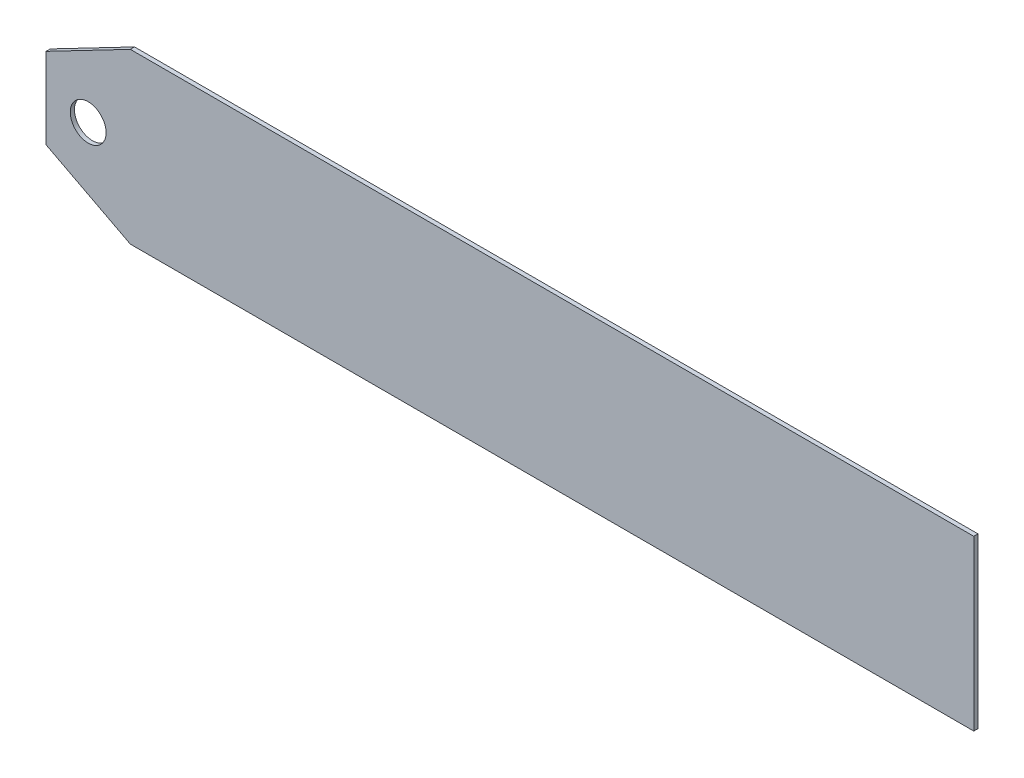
ISO-10303-21;
HEADER;
FILE_DESCRIPTION(('STEP AP214'),'2;1');
FILE_NAME('part.step','',(''),(''),'','','');
FILE_SCHEMA(('AUTOMOTIVE_DESIGN { 1 0 10303 214 1 1 1 1 }'));
ENDSEC;
DATA;
#1=APPLICATION_CONTEXT('core data for automotive mechanical design processes');
#2=APPLICATION_PROTOCOL_DEFINITION('international standard','automotive_design',2000,#1);
#3=PRODUCT_CONTEXT('',#1,'mechanical');
#4=PRODUCT('Part','Part','',(#3));
#5=PRODUCT_RELATED_PRODUCT_CATEGORY('part','',(#4));
#6=PRODUCT_DEFINITION_FORMATION('','',#4);
#7=PRODUCT_DEFINITION_CONTEXT('part definition',#1,'design');
#8=PRODUCT_DEFINITION('design','',#6,#7);
#9=PRODUCT_DEFINITION_SHAPE('','',#8);
#10=(LENGTH_UNIT() NAMED_UNIT(*) SI_UNIT(.MILLI.,.METRE.));
#11=(NAMED_UNIT(*) PLANE_ANGLE_UNIT() SI_UNIT($,.RADIAN.));
#12=(NAMED_UNIT(*) SI_UNIT($,.STERADIAN.) SOLID_ANGLE_UNIT());
#13=UNCERTAINTY_MEASURE_WITH_UNIT(LENGTH_MEASURE(1.E-05),#10,'distance_accuracy_value','');
#14=(GEOMETRIC_REPRESENTATION_CONTEXT(3) GLOBAL_UNCERTAINTY_ASSIGNED_CONTEXT((#13)) GLOBAL_UNIT_ASSIGNED_CONTEXT((#10,
#11,#12)) REPRESENTATION_CONTEXT('',''));
#15=CARTESIAN_POINT('',(0.,0.,0.));
#16=DIRECTION('',(0.,0.,1.));
#17=DIRECTION('',(1.,0.,0.));
#18=AXIS2_PLACEMENT_3D('',#15,#16,#17);
#19=CARTESIAN_POINT('',(-8.67412437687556,15.4845366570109,1.));
#20=DIRECTION('',(-0.461748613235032,0.887010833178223,0.));
#21=DIRECTION('',(-0.887010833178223,-0.461748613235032,0.));
#22=AXIS2_PLACEMENT_3D('',#19,#20,#21);
#23=PLANE('',#22);
#24=DIRECTION('',(0.887010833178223,0.461748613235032,0.));
#25=VECTOR('',#24,1.);
#26=CARTESIAN_POINT('',(-8.67412437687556,15.4845366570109,0.));
#27=LINE('',#26,#25);
#28=CARTESIAN_POINT('',(-20.,9.58865898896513,0.));
#29=VERTEX_POINT('',#28);
#30=CARTESIAN_POINT('',(0.,20.,0.));
#31=VERTEX_POINT('',#30);
#32=EDGE_CURVE('E127',#29,#31,#27,.T.);
#33=ORIENTED_EDGE('',*,*,#32,.F.);
#34=DIRECTION('',(0.,0.,-1.));
#35=VECTOR('',#34,1.);
#36=CARTESIAN_POINT('',(-20.,9.58865898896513,1.));
#37=LINE('',#36,#35);
#38=CARTESIAN_POINT('',(-20.,9.58865898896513,1.));
#39=VERTEX_POINT('',#38);
#40=EDGE_CURVE('E11',#39,#29,#37,.T.);
#41=ORIENTED_EDGE('',*,*,#40,.F.);
#42=DIRECTION('',(0.887010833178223,0.461748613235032,0.));
#43=VECTOR('',#42,1.);
#44=CARTESIAN_POINT('',(-8.67412437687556,15.4845366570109,1.));
#45=LINE('',#44,#43);
#46=CARTESIAN_POINT('',(0.,20.,1.));
#47=VERTEX_POINT('',#46);
#48=EDGE_CURVE('E173',#39,#47,#45,.T.);
#49=ORIENTED_EDGE('',*,*,#48,.T.);
#50=DIRECTION('',(0.,0.,-1.));
#51=VECTOR('',#50,1.);
#52=CARTESIAN_POINT('',(0.,20.,1.));
#53=LINE('',#52,#51);
#54=EDGE_CURVE('E50',#47,#31,#53,.T.);
#55=ORIENTED_EDGE('',*,*,#54,.T.);
#56=EDGE_LOOP('',(#33,#41,#49,#55));
#57=FACE_BOUND('',#56,.T.);
#58=ADVANCED_FACE('F33',(#57),#23,.T.);
#59=CARTESIAN_POINT('',(-20.,-174.066692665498,1.));
#60=DIRECTION('',(1.,0.,0.));
#61=DIRECTION('',(0.,0.,-1.));
#62=AXIS2_PLACEMENT_3D('',#59,#60,#61);
#63=PLANE('',#62);
#64=DIRECTION('',(0.,-1.,0.));
#65=VECTOR('',#64,1.);
#66=CARTESIAN_POINT('',(-20.,-174.066692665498,0.));
#67=LINE('',#66,#65);
#68=CARTESIAN_POINT('',(-20.,-9.58865898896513,0.));
#69=VERTEX_POINT('',#68);
#70=EDGE_CURVE('E124',#29,#69,#67,.T.);
#71=ORIENTED_EDGE('',*,*,#70,.T.);
#72=DIRECTION('',(0.,0.,-1.));
#73=VECTOR('',#72,1.);
#74=CARTESIAN_POINT('',(-20.,-9.58865898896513,1.));
#75=LINE('',#74,#73);
#76=CARTESIAN_POINT('',(-20.,-9.58865898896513,1.));
#77=VERTEX_POINT('',#76);
#78=EDGE_CURVE('E42',#77,#69,#75,.T.);
#79=ORIENTED_EDGE('',*,*,#78,.F.);
#80=DIRECTION('',(0.,-1.,0.));
#81=VECTOR('',#80,1.);
#82=CARTESIAN_POINT('',(-20.,-174.066692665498,1.));
#83=LINE('',#82,#81);
#84=EDGE_CURVE('E175',#39,#77,#83,.T.);
#85=ORIENTED_EDGE('',*,*,#84,.F.);
#86=ORIENTED_EDGE('',*,*,#40,.T.);
#87=EDGE_LOOP('',(#71,#79,#85,#86));
#88=FACE_BOUND('',#87,.T.);
#89=ADVANCED_FACE('F125',(#88),#63,.F.);
#90=CARTESIAN_POINT('',(133.91296276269,-89.7106760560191,1.));
#91=DIRECTION('',(0.461748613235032,0.887010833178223,0.));
#92=DIRECTION('',(-0.887010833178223,0.461748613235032,0.));
#93=AXIS2_PLACEMENT_3D('',#90,#91,#92);
#94=PLANE('',#93);
#95=DIRECTION('',(0.887010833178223,-0.461748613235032,0.));
#96=VECTOR('',#95,1.);
#97=CARTESIAN_POINT('',(133.91296276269,-89.7106760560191,0.));
#98=LINE('',#97,#96);
#99=CARTESIAN_POINT('',(0.,-20.,0.));
#100=VERTEX_POINT('',#99);
#101=EDGE_CURVE('E121',#69,#100,#98,.T.);
#102=ORIENTED_EDGE('',*,*,#101,.T.);
#103=DIRECTION('',(0.,0.,-1.));
#104=VECTOR('',#103,1.);
#105=CARTESIAN_POINT('',(0.,-20.,1.));
#106=LINE('',#105,#104);
#107=CARTESIAN_POINT('',(0.,-20.,1.));
#108=VERTEX_POINT('',#107);
#109=EDGE_CURVE('E110',#108,#100,#106,.T.);
#110=ORIENTED_EDGE('',*,*,#109,.F.);
#111=DIRECTION('',(0.887010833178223,-0.461748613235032,0.));
#112=VECTOR('',#111,1.);
#113=CARTESIAN_POINT('',(133.91296276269,-89.7106760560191,1.));
#114=LINE('',#113,#112);
#115=EDGE_CURVE('E103',#77,#108,#114,.T.);
#116=ORIENTED_EDGE('',*,*,#115,.F.);
#117=ORIENTED_EDGE('',*,*,#78,.T.);
#118=EDGE_LOOP('',(#102,#110,#116,#117));
#119=FACE_BOUND('',#118,.T.);
#120=ADVANCED_FACE('F120',(#119),#94,.F.);
#121=CARTESIAN_POINT('',(90.,-20.,1.));
#122=DIRECTION('',(0.,1.,0.));
#123=DIRECTION('',(0.,0.,1.));
#124=AXIS2_PLACEMENT_3D('',#121,#122,#123);
#125=PLANE('',#124);
#126=DIRECTION('',(1.,0.,0.));
#127=VECTOR('',#126,1.);
#128=CARTESIAN_POINT('',(90.,-20.,0.));
#129=LINE('',#128,#127);
#130=CARTESIAN_POINT('',(200.,-20.,0.));
#131=VERTEX_POINT('',#130);
#132=EDGE_CURVE('E109',#100,#131,#129,.T.);
#133=ORIENTED_EDGE('',*,*,#132,.T.);
#134=DIRECTION('',(0.,0.,-1.));
#135=VECTOR('',#134,1.);
#136=CARTESIAN_POINT('',(200.,-20.,1.));
#137=LINE('',#136,#135);
#138=CARTESIAN_POINT('',(200.,-20.,1.));
#139=VERTEX_POINT('',#138);
#140=EDGE_CURVE('E92',#139,#131,#137,.T.);
#141=ORIENTED_EDGE('',*,*,#140,.F.);
#142=DIRECTION('',(1.,0.,0.));
#143=VECTOR('',#142,1.);
#144=CARTESIAN_POINT('',(90.,-20.,1.));
#145=LINE('',#144,#143);
#146=EDGE_CURVE('E97',#108,#139,#145,.T.);
#147=ORIENTED_EDGE('',*,*,#146,.F.);
#148=ORIENTED_EDGE('',*,*,#109,.T.);
#149=EDGE_LOOP('',(#133,#141,#147,#148));
#150=FACE_BOUND('',#149,.T.);
#151=ADVANCED_FACE('F108',(#150),#125,.F.);
#152=CARTESIAN_POINT('',(200.,-174.066692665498,1.));
#153=DIRECTION('',(-1.,0.,0.));
#154=DIRECTION('',(0.,0.,1.));
#155=AXIS2_PLACEMENT_3D('',#152,#153,#154);
#156=PLANE('',#155);
#157=DIRECTION('',(0.,1.,0.));
#158=VECTOR('',#157,1.);
#159=CARTESIAN_POINT('',(200.,-174.066692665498,0.));
#160=LINE('',#159,#158);
#161=CARTESIAN_POINT('',(200.,20.,0.));
#162=VERTEX_POINT('',#161);
#163=EDGE_CURVE('E135',#131,#162,#160,.T.);
#164=ORIENTED_EDGE('',*,*,#163,.T.);
#165=DIRECTION('',(0.,0.,-1.));
#166=VECTOR('',#165,1.);
#167=CARTESIAN_POINT('',(200.,20.,1.));
#168=LINE('',#167,#166);
#169=CARTESIAN_POINT('',(200.,20.,1.));
#170=VERTEX_POINT('',#169);
#171=EDGE_CURVE('E70',#170,#162,#168,.T.);
#172=ORIENTED_EDGE('',*,*,#171,.F.);
#173=DIRECTION('',(0.,1.,0.));
#174=VECTOR('',#173,1.);
#175=CARTESIAN_POINT('',(200.,-174.066692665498,1.));
#176=LINE('',#175,#174);
#177=EDGE_CURVE('E88',#139,#170,#176,.T.);
#178=ORIENTED_EDGE('',*,*,#177,.F.);
#179=ORIENTED_EDGE('',*,*,#140,.T.);
#180=EDGE_LOOP('',(#164,#172,#178,#179));
#181=FACE_BOUND('',#180,.T.);
#182=ADVANCED_FACE('F90',(#181),#156,.F.);
#183=CARTESIAN_POINT('',(-9.99999999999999,0.,1.));
#184=DIRECTION('',(0.,0.,-1.));
#185=DIRECTION('',(-1.,0.,0.));
#186=AXIS2_PLACEMENT_3D('',#183,#184,#185);
#187=CYLINDRICAL_SURFACE('',#186,4.25);
#188=CARTESIAN_POINT('',(-9.99999999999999,0.,1.));
#189=DIRECTION('',(0.,0.,1.));
#190=DIRECTION('',(1.,0.,0.));
#191=AXIS2_PLACEMENT_3D('',#188,#189,#190);
#192=CIRCLE('',#191,4.25);
#193=CARTESIAN_POINT('',(-5.74999999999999,0.,1.));
#194=VERTEX_POINT('',#193);
#195=EDGE_CURVE('E139',#194,#194,#192,.T.);
#196=ORIENTED_EDGE('',*,*,#195,.T.);
#197=EDGE_LOOP('',(#196));
#198=FACE_BOUND('',#197,.T.);
#199=CARTESIAN_POINT('',(-9.99999999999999,0.,0.));
#200=DIRECTION('',(0.,0.,1.));
#201=DIRECTION('',(1.,0.,0.));
#202=AXIS2_PLACEMENT_3D('',#199,#200,#201);
#203=CIRCLE('',#202,4.25);
#204=CARTESIAN_POINT('',(-5.74999999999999,0.,0.));
#205=VERTEX_POINT('',#204);
#206=EDGE_CURVE('E130',#205,#205,#203,.T.);
#207=ORIENTED_EDGE('',*,*,#206,.F.);
#208=EDGE_LOOP('',(#207));
#209=FACE_BOUND('',#208,.T.);
#210=ADVANCED_FACE('F35',(#198,#209),#187,.F.);
#211=CARTESIAN_POINT('',(90.,20.,1.));
#212=DIRECTION('',(0.,1.,0.));
#213=DIRECTION('',(0.,0.,1.));
#214=AXIS2_PLACEMENT_3D('',#211,#212,#213);
#215=PLANE('',#214);
#216=DIRECTION('',(1.,0.,0.));
#217=VECTOR('',#216,1.);
#218=CARTESIAN_POINT('',(90.,20.,0.));
#219=LINE('',#218,#217);
#220=EDGE_CURVE('E137',#31,#162,#219,.T.);
#221=ORIENTED_EDGE('',*,*,#220,.F.);
#222=ORIENTED_EDGE('',*,*,#54,.F.);
#223=DIRECTION('',(1.,0.,0.));
#224=VECTOR('',#223,1.);
#225=CARTESIAN_POINT('',(90.,20.,1.));
#226=LINE('',#225,#224);
#227=EDGE_CURVE('E96',#47,#170,#226,.T.);
#228=ORIENTED_EDGE('',*,*,#227,.T.);
#229=ORIENTED_EDGE('',*,*,#171,.T.);
#230=EDGE_LOOP('',(#221,#222,#228,#229));
#231=FACE_BOUND('',#230,.T.);
#232=ADVANCED_FACE('F147',(#231),#215,.T.);
#233=CARTESIAN_POINT('',(90.,-174.066692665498,1.));
#234=DIRECTION('',(0.,0.,1.));
#235=DIRECTION('',(1.,0.,0.));
#236=AXIS2_PLACEMENT_3D('',#233,#234,#235);
#237=PLANE('',#236);
#238=ORIENTED_EDGE('',*,*,#195,.F.);
#239=EDGE_LOOP('',(#238));
#240=FACE_BOUND('',#239,.T.);
#241=ORIENTED_EDGE('',*,*,#48,.F.);
#242=ORIENTED_EDGE('',*,*,#84,.T.);
#243=ORIENTED_EDGE('',*,*,#115,.T.);
#244=ORIENTED_EDGE('',*,*,#146,.T.);
#245=ORIENTED_EDGE('',*,*,#177,.T.);
#246=ORIENTED_EDGE('',*,*,#227,.F.);
#247=EDGE_LOOP('',(#241,#242,#243,#244,#245,#246));
#248=FACE_BOUND('',#247,.T.);
#249=ADVANCED_FACE('F101',(#240,#248),#237,.T.);
#250=CARTESIAN_POINT('',(90.,-174.066692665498,0.));
#251=DIRECTION('',(0.,0.,1.));
#252=DIRECTION('',(1.,0.,0.));
#253=AXIS2_PLACEMENT_3D('',#250,#251,#252);
#254=PLANE('',#253);
#255=ORIENTED_EDGE('',*,*,#206,.T.);
#256=EDGE_LOOP('',(#255));
#257=FACE_BOUND('',#256,.T.);
#258=ORIENTED_EDGE('',*,*,#32,.T.);
#259=ORIENTED_EDGE('',*,*,#220,.T.);
#260=ORIENTED_EDGE('',*,*,#163,.F.);
#261=ORIENTED_EDGE('',*,*,#132,.F.);
#262=ORIENTED_EDGE('',*,*,#101,.F.);
#263=ORIENTED_EDGE('',*,*,#70,.F.);
#264=EDGE_LOOP('',(#258,#259,#260,#261,#262,#263));
#265=FACE_BOUND('',#264,.T.);
#266=ADVANCED_FACE('F144',(#257,#265),#254,.F.);
#267=CLOSED_SHELL('',(#58,#89,#120,#151,#182,#210,#232,#249,#266));
#268=MANIFOLD_SOLID_BREP('B2',#267);
#269=ADVANCED_BREP_SHAPE_REPRESENTATION('',(#18,#268),#14);
#270=SHAPE_DEFINITION_REPRESENTATION(#9,#269);
ENDSEC;
END-ISO-10303-21;
